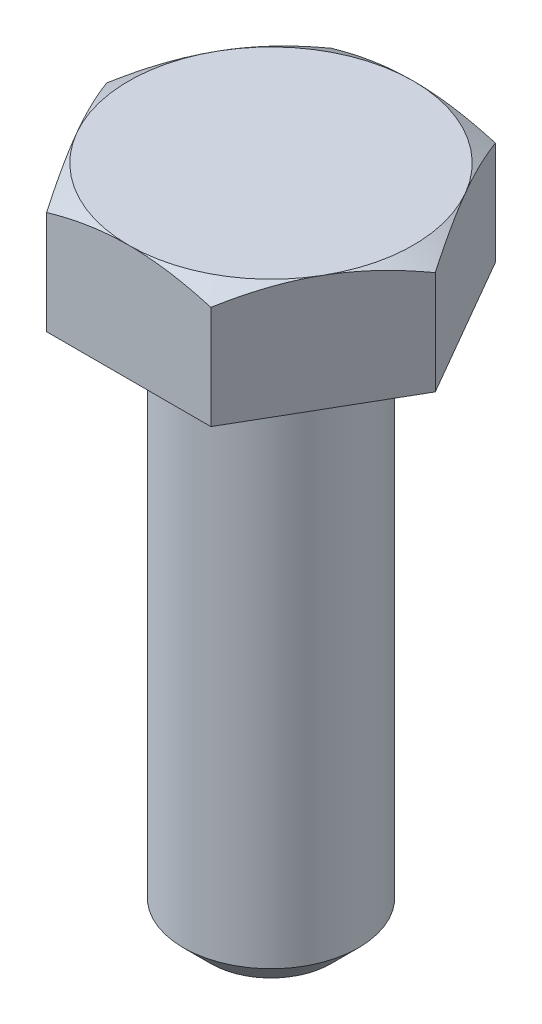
ISO-10303-21;
HEADER;
FILE_DESCRIPTION(('STEP AP214'),'2;1');
FILE_NAME('part.step','',(''),(''),'','','');
FILE_SCHEMA(('AUTOMOTIVE_DESIGN { 1 0 10303 214 1 1 1 1 }'));
ENDSEC;
DATA;
#1=APPLICATION_CONTEXT('core data for automotive mechanical design processes');
#2=APPLICATION_PROTOCOL_DEFINITION('international standard','automotive_design',2000,#1);
#3=PRODUCT_CONTEXT('',#1,'mechanical');
#4=PRODUCT('Part','Part','',(#3));
#5=PRODUCT_RELATED_PRODUCT_CATEGORY('part','',(#4));
#6=PRODUCT_DEFINITION_FORMATION('','',#4);
#7=PRODUCT_DEFINITION_CONTEXT('part definition',#1,'design');
#8=PRODUCT_DEFINITION('design','',#6,#7);
#9=PRODUCT_DEFINITION_SHAPE('','',#8);
#10=(LENGTH_UNIT() NAMED_UNIT(*) SI_UNIT(.MILLI.,.METRE.));
#11=(NAMED_UNIT(*) PLANE_ANGLE_UNIT() SI_UNIT($,.RADIAN.));
#12=(NAMED_UNIT(*) SI_UNIT($,.STERADIAN.) SOLID_ANGLE_UNIT());
#13=UNCERTAINTY_MEASURE_WITH_UNIT(LENGTH_MEASURE(1.E-05),#10,'distance_accuracy_value','');
#14=(GEOMETRIC_REPRESENTATION_CONTEXT(3) GLOBAL_UNCERTAINTY_ASSIGNED_CONTEXT((#13)) GLOBAL_UNIT_ASSIGNED_CONTEXT((#10,
#11,#12)) REPRESENTATION_CONTEXT('',''));
#15=CARTESIAN_POINT('',(0.,0.,0.));
#16=DIRECTION('',(0.,0.,1.));
#17=DIRECTION('',(1.,0.,0.));
#18=AXIS2_PLACEMENT_3D('',#15,#16,#17);
#19=CARTESIAN_POINT('',(0.,0.,0.));
#20=DIRECTION('',(0.,1.,0.));
#21=DIRECTION('',(0.,0.,1.));
#22=AXIS2_PLACEMENT_3D('',#19,#20,#21);
#23=PLANE('',#22);
#24=CARTESIAN_POINT('',(0.,0.,0.));
#25=DIRECTION('',(0.,1.,0.));
#26=DIRECTION('',(0.,0.,1.));
#27=AXIS2_PLACEMENT_3D('',#24,#25,#26);
#28=CIRCLE('',#27,4.);
#29=CARTESIAN_POINT('',(0.,0.,4.00000000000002));
#30=VERTEX_POINT('',#29);
#31=EDGE_CURVE('E189',#30,#30,#28,.T.);
#32=ORIENTED_EDGE('',*,*,#31,.T.);
#33=EDGE_LOOP('',(#32));
#34=FACE_BOUND('',#33,.T.);
#35=DIRECTION('',(0.499999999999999,0.,0.866025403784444));
#36=VECTOR('',#35,1.);
#37=CARTESIAN_POINT('',(3.75277674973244,0.,-6.4999999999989));
#38=LINE('',#37,#36);
#39=CARTESIAN_POINT('',(3.75277674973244,0.,-6.4999999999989));
#40=VERTEX_POINT('',#39);
#41=CARTESIAN_POINT('',(7.50555349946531,-1.94289029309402E-13,9.99200722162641E-13));
#42=VERTEX_POINT('',#41);
#43=EDGE_CURVE('E126',#40,#42,#38,.T.);
#44=ORIENTED_EDGE('',*,*,#43,.T.);
#45=DIRECTION('',(-0.5,0.,0.866025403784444));
#46=VECTOR('',#45,1.);
#47=CARTESIAN_POINT('',(3.7527767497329,0.,6.50000000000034));
#48=LINE('',#47,#46);
#49=CARTESIAN_POINT('',(3.7527767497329,0.,6.50000000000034));
#50=VERTEX_POINT('',#49);
#51=EDGE_CURVE('E124',#42,#50,#48,.T.);
#52=ORIENTED_EDGE('',*,*,#51,.T.);
#53=DIRECTION('',(-1.,0.,0.));
#54=VECTOR('',#53,1.);
#55=CARTESIAN_POINT('',(-3.75277674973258,0.,6.50000000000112));
#56=LINE('',#55,#54);
#57=CARTESIAN_POINT('',(-3.75277674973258,0.,6.50000000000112));
#58=VERTEX_POINT('',#57);
#59=EDGE_CURVE('E54',#50,#58,#56,.T.);
#60=ORIENTED_EDGE('',*,*,#59,.T.);
#61=DIRECTION('',(-0.499999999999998,0.,-0.866025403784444));
#62=VECTOR('',#61,1.);
#63=CARTESIAN_POINT('',(-3.75277674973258,0.,6.50000000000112));
#64=LINE('',#63,#62);
#65=CARTESIAN_POINT('',(-7.50555349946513,-1.38777878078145E-13,4.9960036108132E-13));
#66=VERTEX_POINT('',#65);
#67=EDGE_CURVE('E113',#58,#66,#64,.T.);
#68=ORIENTED_EDGE('',*,*,#67,.T.);
#69=DIRECTION('',(0.5,0.,-0.866025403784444));
#70=VECTOR('',#69,1.);
#71=CARTESIAN_POINT('',(-3.7527767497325,0.,-6.4999999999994));
#72=LINE('',#71,#70);
#73=CARTESIAN_POINT('',(-3.7527767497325,0.,-6.4999999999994));
#74=VERTEX_POINT('',#73);
#75=EDGE_CURVE('E119',#66,#74,#72,.T.);
#76=ORIENTED_EDGE('',*,*,#75,.T.);
#77=DIRECTION('',(1.,0.,0.));
#78=VECTOR('',#77,1.);
#79=CARTESIAN_POINT('',(-3.7527767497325,0.,-6.4999999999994));
#80=LINE('',#79,#78);
#81=EDGE_CURVE('E131',#74,#40,#80,.T.);
#82=ORIENTED_EDGE('',*,*,#81,.T.);
#83=EDGE_LOOP('',(#44,#52,#60,#68,#76,#82));
#84=FACE_BOUND('',#83,.T.);
#85=ADVANCED_FACE('F31',(#34,#84),#23,.F.);
#86=CARTESIAN_POINT('',(-2.65412691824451E-13,-25.0000000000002,7.7715611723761E-13));
#87=DIRECTION('',(0.,1.,0.));
#88=DIRECTION('',(0.,0.,1.));
#89=AXIS2_PLACEMENT_3D('',#86,#87,#88);
#90=CYLINDRICAL_SURFACE('',#89,4.);
#91=CARTESIAN_POINT('',(0.,-23.7500000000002,1.38777878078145E-12));
#92=DIRECTION('',(0.,1.,0.));
#93=DIRECTION('',(0.,0.,1.));
#94=AXIS2_PLACEMENT_3D('',#91,#92,#93);
#95=CIRCLE('',#94,4.);
#96=CARTESIAN_POINT('',(0.,-23.7500000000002,4.00000000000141));
#97=VERTEX_POINT('',#96);
#98=EDGE_CURVE('E39',#97,#97,#95,.T.);
#99=ORIENTED_EDGE('',*,*,#98,.T.);
#100=EDGE_LOOP('',(#99));
#101=FACE_BOUND('',#100,.T.);
#102=ORIENTED_EDGE('',*,*,#31,.F.);
#103=EDGE_LOOP('',(#102));
#104=FACE_BOUND('',#103,.T.);
#105=ADVANCED_FACE('F33',(#101,#104),#90,.T.);
#106=CARTESIAN_POINT('',(-2.65412691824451E-13,-25.0000000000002,7.7715611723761E-13));
#107=DIRECTION('',(0.,1.,0.));
#108=DIRECTION('',(0.,0.,1.));
#109=AXIS2_PLACEMENT_3D('',#106,#107,#108);
#110=PLANE('',#109);
#111=CARTESIAN_POINT('',(-2.65412691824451E-13,-25.0000000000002,7.7715611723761E-13));
#112=DIRECTION('',(0.,1.,0.));
#113=DIRECTION('',(0.,0.,1.));
#114=AXIS2_PLACEMENT_3D('',#111,#112,#113);
#115=CIRCLE('',#114,2.74999999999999);
#116=CARTESIAN_POINT('',(-2.67320887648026E-13,-25.0000000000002,2.75000000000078));
#117=VERTEX_POINT('',#116);
#118=EDGE_CURVE('E11',#117,#117,#115,.F.);
#119=ORIENTED_EDGE('',*,*,#118,.T.);
#120=EDGE_LOOP('',(#119));
#121=FACE_BOUND('',#120,.T.);
#122=ADVANCED_FACE('F199',(#121),#110,.F.);
#123=CARTESIAN_POINT('',(0.,-23.7500000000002,1.38777878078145E-12));
#124=DIRECTION('',(0.,1.,0.));
#125=DIRECTION('',(0.,0.,1.));
#126=AXIS2_PLACEMENT_3D('',#123,#124,#125);
#127=CONICAL_SURFACE('',#126,4.,0.785398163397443);
#128=ORIENTED_EDGE('',*,*,#118,.F.);
#129=EDGE_LOOP('',(#128));
#130=FACE_BOUND('',#129,.T.);
#131=ORIENTED_EDGE('',*,*,#98,.F.);
#132=EDGE_LOOP('',(#131));
#133=FACE_BOUND('',#132,.T.);
#134=ADVANCED_FACE('F169',(#130,#133),#127,.T.);
#135=CARTESIAN_POINT('',(3.75277674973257,5.3,-6.4999999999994));
#136=DIRECTION('',(0.866025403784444,0.,-0.5));
#137=DIRECTION('',(-0.499999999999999,0.,-0.866025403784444));
#138=AXIS2_PLACEMENT_3D('',#135,#136,#137);
#139=PLANE('',#138);
#140=CARTESIAN_POINT('',(3.7526612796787,4.71937674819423,-6.50019999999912));
#141=CARTESIAN_POINT('',(3.83515161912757,4.76699557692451,-6.35732254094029));
#142=CARTESIAN_POINT('',(3.91794952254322,4.81245329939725,-6.21391236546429));
#143=CARTESIAN_POINT('',(4.08421773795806,4.89845131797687,-5.92592736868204));
#144=CARTESIAN_POINT('',(4.16768832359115,4.9389894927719,-5.78135207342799));
#145=CARTESIAN_POINT('',(4.41943655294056,5.05242899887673,-5.34531134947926));
#146=CARTESIAN_POINT('',(4.58870793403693,5.11695219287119,-5.05212471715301));
#147=CARTESIAN_POINT('',(4.84201947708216,5.19261341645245,-4.61337625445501));
#148=CARTESIAN_POINT('',(4.92530276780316,5.21416714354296,-4.46912536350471));
#149=CARTESIAN_POINT('',(5.09224566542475,5.25030968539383,-4.17997178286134));
#150=CARTESIAN_POINT('',(5.17590523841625,5.26489911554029,-4.03506915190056));
#151=CARTESIAN_POINT('',(5.34336968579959,5.28674124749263,-3.74501222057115));
#152=CARTESIAN_POINT('',(5.42717428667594,5.29400227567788,-3.59985839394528));
#153=CARTESIAN_POINT('',(5.59485627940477,5.30103969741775,-3.30942466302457));
#154=CARTESIAN_POINT('',(5.67873366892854,5.30081632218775,-3.16414476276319));
#155=CARTESIAN_POINT('',(5.90853103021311,5.28991654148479,-2.76612405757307));
#156=CARTESIAN_POINT('',(6.05437578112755,5.27161818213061,-2.51351353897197));
#157=CARTESIAN_POINT('',(6.34509659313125,5.21359365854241,-2.00997032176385));
#158=CARTESIAN_POINT('',(6.48997163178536,5.17384766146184,-1.75903939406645));
#159=CARTESIAN_POINT('',(6.78127752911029,5.07449409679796,-1.2544827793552));
#160=CARTESIAN_POINT('',(6.92767163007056,5.01446557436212,-1.00092075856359));
#161=CARTESIAN_POINT('',(7.21827667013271,4.87822500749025,-0.497578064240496));
#162=CARTESIAN_POINT('',(7.36249133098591,4.80204496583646,-0.247790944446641));
#163=CARTESIAN_POINT('',(7.5056689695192,4.719376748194,0.000200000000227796));
#164=B_SPLINE_CURVE_WITH_KNOTS('',3,(#140,#141,#142,#143,#144,#145,#146,#147,#148,#149,#150,
#151,#152,#153,#154,#155,#156,#157,#158,#159,#160,#161,#162,#163),.UNSPECIFIED.,.F.,.F.,(4,2,2,
2,2,2,2,2,2,2,2,4),(0.,0.515105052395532,1.03043143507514,2.0632255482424,2.56697389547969,
3.07067772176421,3.5738086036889,4.07692394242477,4.95279354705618,5.82947446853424,
6.72559912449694,7.61996451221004),.UNSPECIFIED.);
#165=CARTESIAN_POINT('',(3.75277674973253,4.71944341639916,-6.4999999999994));
#166=VERTEX_POINT('',#165);
#167=CARTESIAN_POINT('',(5.6291651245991,5.30000000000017,-3.24999999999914));
#168=VERTEX_POINT('',#167);
#169=EDGE_CURVE('E178',#166,#168,#164,.T.);
#170=ORIENTED_EDGE('',*,*,#169,.T.);
#171=CARTESIAN_POINT('',(7.50555349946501,4.7194434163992,3.33066907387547E-13));
#172=VERTEX_POINT('',#171);
#173=EDGE_CURVE('E172',#168,#172,#164,.T.);
#174=ORIENTED_EDGE('',*,*,#173,.T.);
#175=DIRECTION('',(0.,-1.,0.));
#176=VECTOR('',#175,1.);
#177=CARTESIAN_POINT('',(7.5055534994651,5.30000000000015,1.33226762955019E-12));
#178=LINE('',#177,#176);
#179=EDGE_CURVE('E134',#172,#42,#178,.T.);
#180=ORIENTED_EDGE('',*,*,#179,.T.);
#181=ORIENTED_EDGE('',*,*,#43,.F.);
#182=DIRECTION('',(0.,-1.,0.));
#183=VECTOR('',#182,1.);
#184=CARTESIAN_POINT('',(3.75277674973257,5.3,-6.4999999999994));
#185=LINE('',#184,#183);
#186=EDGE_CURVE('E135',#166,#40,#185,.T.);
#187=ORIENTED_EDGE('',*,*,#186,.F.);
#188=EDGE_LOOP('',(#170,#174,#180,#181,#187));
#189=FACE_BOUND('',#188,.T.);
#190=ADVANCED_FACE('F165',(#189),#139,.T.);
#191=CARTESIAN_POINT('',(-3.75277674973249,5.2999999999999,-6.49999999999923));
#192=DIRECTION('',(0.,0.,-1.));
#193=DIRECTION('',(-1.,0.,0.));
#194=AXIS2_PLACEMENT_3D('',#191,#192,#193);
#195=PLANE('',#194);
#196=CARTESIAN_POINT('',(-10.0886341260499,2.12383891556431,-6.49999999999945));
#197=CARTESIAN_POINT('',(-9.80467346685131,2.26161831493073,-6.49999999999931));
#198=CARTESIAN_POINT('',(-9.52006184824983,2.3980790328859,-6.49999999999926));
#199=CARTESIAN_POINT('',(-8.94919056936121,2.66762164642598,-6.49999999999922));
#200=CARTESIAN_POINT('',(-8.66293065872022,2.80070301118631,-6.49999999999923));
#201=CARTESIAN_POINT('',(-8.08694566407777,3.06341325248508,-6.49999999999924));
#202=CARTESIAN_POINT('',(-7.79721020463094,3.19301945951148,-6.49999999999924));
#203=CARTESIAN_POINT('',(-7.21543776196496,3.44693914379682,-6.49999999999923));
#204=CARTESIAN_POINT('',(-6.92340088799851,3.57125287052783,-6.49999999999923));
#205=CARTESIAN_POINT('',(-6.32709029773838,3.81709528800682,-6.49999999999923));
#206=CARTESIAN_POINT('',(-6.02272572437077,3.93840479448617,-6.49999999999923));
#207=CARTESIAN_POINT('',(-5.41043840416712,4.17186244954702,-6.49999999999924));
#208=CARTESIAN_POINT('',(-5.1025152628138,4.28400957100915,-6.49999999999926));
#209=CARTESIAN_POINT('',(-4.48319586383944,4.49620465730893,-6.4999999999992));
#210=CARTESIAN_POINT('',(-4.17180805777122,4.59627704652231,-6.49999999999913));
#211=CARTESIAN_POINT('',(-3.54456226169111,4.78111569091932,-6.49999999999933));
#212=CARTESIAN_POINT('',(-3.2287057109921,4.86588675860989,-6.49999999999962));
#213=CARTESIAN_POINT('',(-2.59412088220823,5.01561043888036,-6.49999999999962));
#214=CARTESIAN_POINT('',(-2.27541854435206,5.08067123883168,-6.49999999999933));
#215=CARTESIAN_POINT('',(-1.63399658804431,5.18729065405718,-6.49999999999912));
#216=CARTESIAN_POINT('',(-1.31127735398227,5.22885150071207,-6.4999999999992));
#217=CARTESIAN_POINT('',(-0.827615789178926,5.27080862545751,-6.49999999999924));
#218=CARTESIAN_POINT('',(-0.667517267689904,5.2813926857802,-6.49999999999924));
#219=CARTESIAN_POINT('',(-0.347009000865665,5.29578640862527,-6.49999999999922));
#220=CARTESIAN_POINT('',(-0.18659926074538,5.29959618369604,-6.4999999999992));
#221=CARTESIAN_POINT('',(0.134235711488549,5.30034292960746,-6.49999999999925));
#222=CARTESIAN_POINT('',(0.294660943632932,5.29727988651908,-6.49999999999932));
#223=CARTESIAN_POINT('',(0.615239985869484,5.28435797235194,-6.49999999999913));
#224=CARTESIAN_POINT('',(0.775393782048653,5.27449876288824,-6.49999999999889));
#225=CARTESIAN_POINT('',(1.16005135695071,5.24286537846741,-6.49999999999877));
#226=CARTESIAN_POINT('',(1.38429657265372,5.21787974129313,-6.4999999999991));
#227=CARTESIAN_POINT('',(1.83111749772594,5.15594502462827,-6.49999999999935));
#228=CARTESIAN_POINT('',(2.05369297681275,5.11899432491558,-6.49999999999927));
#229=CARTESIAN_POINT('',(2.71866395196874,4.9921542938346,-6.49999999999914));
#230=CARTESIAN_POINT('',(3.15805424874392,4.88630028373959,-6.49999999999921));
#231=CARTESIAN_POINT('',(3.81504923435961,4.70280580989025,-6.49999999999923));
#232=CARTESIAN_POINT('',(4.03606367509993,4.63667213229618,-6.49999999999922));
#233=CARTESIAN_POINT('',(4.47594594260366,4.4975509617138,-6.49999999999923));
#234=CARTESIAN_POINT('',(4.69481375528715,4.42456342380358,-6.49999999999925));
#235=CARTESIAN_POINT('',(5.13047166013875,4.27290430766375,-6.4999999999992));
#236=CARTESIAN_POINT('',(5.34726241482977,4.19423461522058,-6.49999999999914));
#237=CARTESIAN_POINT('',(5.77904901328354,4.03213528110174,-6.4999999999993));
#238=CARTESIAN_POINT('',(5.99404487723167,3.94870569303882,-6.49999999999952));
#239=CARTESIAN_POINT('',(6.49787798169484,3.74779518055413,-6.49999999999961));
#240=CARTESIAN_POINT('',(6.78605784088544,3.62866885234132,-6.49999999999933));
#241=CARTESIAN_POINT('',(7.3599886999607,3.38468569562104,-6.49999999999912));
#242=CARTESIAN_POINT('',(7.64573955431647,3.25982852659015,-6.4999999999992));
#243=CARTESIAN_POINT('',(8.2152536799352,3.00552358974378,-6.49999999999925));
#244=CARTESIAN_POINT('',(8.49901654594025,2.87607491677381,-6.49999999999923));
#245=CARTESIAN_POINT('',(9.06483738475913,2.61349711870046,-6.49999999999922));
#246=CARTESIAN_POINT('',(9.34689532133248,2.48036791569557,-6.49999999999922));
#247=CARTESIAN_POINT('',(9.90987358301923,2.21097485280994,-6.49999999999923));
#248=CARTESIAN_POINT('',(10.190792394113,2.07470783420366,-6.49999999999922));
#249=CARTESIAN_POINT('',(10.7514193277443,1.79970338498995,-6.49999999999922));
#250=CARTESIAN_POINT('',(11.0311274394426,1.66096593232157,-6.49999999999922));
#251=CARTESIAN_POINT('',(11.8686493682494,1.2417363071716,-6.49999999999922));
#252=CARTESIAN_POINT('',(12.4249348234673,0.958191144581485,-6.49999999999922));
#253=CARTESIAN_POINT('',(13.4885090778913,0.409121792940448,-6.49999999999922));
#254=CARTESIAN_POINT('',(13.9960344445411,0.144053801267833,-6.49999999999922));
#255=CARTESIAN_POINT('',(15.009185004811,-0.389728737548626,-6.49999999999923));
#256=CARTESIAN_POINT('',(15.5148101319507,-0.65844341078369,-6.49999999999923));
#257=CARTESIAN_POINT('',(16.5233284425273,-1.19798632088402,-6.49999999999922));
#258=CARTESIAN_POINT('',(17.0262252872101,-1.46880772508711,-6.4999999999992));
#259=CARTESIAN_POINT('',(18.0308017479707,-2.01263443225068,-6.49999999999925));
#260=CARTESIAN_POINT('',(18.5324814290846,-2.28563961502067,-6.49999999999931));
#261=CARTESIAN_POINT('',(19.0337121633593,-2.55946102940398,-6.49999999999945));
#262=B_SPLINE_CURVE_WITH_KNOTS('',3,(#196,#197,#198,#199,#200,#201,#202,#203,#204,#205,#206,
#207,#208,#209,#210,#211,#212,#213,#214,#215,#216,#217,#218,#219,#220,#221,#222,#223,#224,#225,
#226,#227,#228,#229,#230,#231,#232,#233,#234,#235,#236,#237,#238,#239,#240,#241,#242,#243,#244,
#245,#246,#247,#248,#249,#250,#251,#252,#253,#254,#255,#256,#257,#258,#259,#260,#261),
.UNSPECIFIED.,.F.,.F.,(4,2,2,2,2,2,2,2,2,2,2,2,2,2,2,2,2,2,2,2,2,2,2,2,2,2,2,2,2,2,2,2,4),(0.,
0.946875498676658,1.89389882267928,2.84606421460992,3.7981846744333,4.78101743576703,
5.76396022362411,6.74488017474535,7.72549107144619,8.70061769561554,9.67565171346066,
10.1568741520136,10.6380885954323,11.1193040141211,11.600543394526,12.2770600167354,
12.9536682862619,14.3076338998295,14.9996668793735,15.6917043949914,16.3835132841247,
17.0753143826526,18.0107249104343,18.9461910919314,19.8818427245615,20.8175141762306,
21.7541727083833,22.6908396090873,24.5639268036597,26.281638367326,27.9994094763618,
29.7129512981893,31.4263994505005),.UNSPECIFIED.);
#263=CARTESIAN_POINT('',(-3.75277674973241,4.71944341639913,-6.49999999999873));
#264=VERTEX_POINT('',#263);
#265=CARTESIAN_POINT('',(-1.02348685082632E-13,5.3,-6.49999999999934));
#266=VERTEX_POINT('',#265);
#267=EDGE_CURVE('E179',#264,#266,#262,.T.);
#268=ORIENTED_EDGE('',*,*,#267,.T.);
#269=EDGE_CURVE('E180',#266,#166,#262,.T.);
#270=ORIENTED_EDGE('',*,*,#269,.T.);
#271=ORIENTED_EDGE('',*,*,#186,.T.);
#272=ORIENTED_EDGE('',*,*,#81,.F.);
#273=DIRECTION('',(0.,-1.,0.));
#274=VECTOR('',#273,1.);
#275=CARTESIAN_POINT('',(-3.75277674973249,5.2999999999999,-6.49999999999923));
#276=LINE('',#275,#274);
#277=EDGE_CURVE('E138',#264,#74,#276,.T.);
#278=ORIENTED_EDGE('',*,*,#277,.F.);
#279=EDGE_LOOP('',(#268,#270,#271,#272,#278));
#280=FACE_BOUND('',#279,.T.);
#281=ADVANCED_FACE('F168',(#280),#195,.T.);
#282=CARTESIAN_POINT('',(-3.75277674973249,5.2999999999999,-6.49999999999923));
#283=DIRECTION('',(-0.866025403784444,0.,-0.499999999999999));
#284=DIRECTION('',(-0.5,0.,0.866025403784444));
#285=AXIS2_PLACEMENT_3D('',#282,#283,#284);
#286=PLANE('',#285);
#287=CARTESIAN_POINT('',(-7.50566896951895,4.71937674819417,0.000200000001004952));
#288=CARTESIAN_POINT('',(-7.42317863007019,4.76699557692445,-0.142677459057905));
#289=CARTESIAN_POINT('',(-7.34038072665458,4.81245329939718,-0.286087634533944));
#290=CARTESIAN_POINT('',(-7.17411251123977,4.8984513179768,-0.574072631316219));
#291=CARTESIAN_POINT('',(-7.09064192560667,4.93898949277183,-0.718647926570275));
#292=CARTESIAN_POINT('',(-6.83889369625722,5.05242899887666,-1.15468865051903));
#293=CARTESIAN_POINT('',(-6.66962231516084,5.11695219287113,-1.44787528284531));
#294=CARTESIAN_POINT('',(-6.41631077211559,5.19261341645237,-1.88662374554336));
#295=CARTESIAN_POINT('',(-6.33302748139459,5.21416714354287,-2.03087463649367));
#296=CARTESIAN_POINT('',(-6.16608458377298,5.25030968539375,-2.32002821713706));
#297=CARTESIAN_POINT('',(-6.08242501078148,5.26489911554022,-2.46493084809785));
#298=CARTESIAN_POINT('',(-5.91496056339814,5.28674124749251,-2.75498777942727));
#299=CARTESIAN_POINT('',(-5.8311559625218,5.29400227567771,-2.90014160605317));
#300=CARTESIAN_POINT('',(-5.66347396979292,5.3010396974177,-3.19057533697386));
#301=CARTESIAN_POINT('',(-5.5795965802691,5.30081632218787,-3.33585523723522));
#302=CARTESIAN_POINT('',(-5.34979921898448,5.28991654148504,-3.73387594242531));
#303=CARTESIAN_POINT('',(-5.20395446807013,5.27161818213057,-3.98648646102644));
#304=CARTESIAN_POINT('',(-4.9132336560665,5.21359365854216,-4.4900296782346));
#305=CARTESIAN_POINT('',(-4.76835861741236,5.17384766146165,-4.74096060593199));
#306=CARTESIAN_POINT('',(-4.4770527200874,5.0744940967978,-5.24551722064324));
#307=CARTESIAN_POINT('',(-4.33065861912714,5.01446557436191,-5.49907924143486));
#308=CARTESIAN_POINT('',(-4.04005357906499,4.87822500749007,-6.00242193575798));
#309=CARTESIAN_POINT('',(-3.89583891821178,4.80204496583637,-6.25220905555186));
#310=CARTESIAN_POINT('',(-3.75266127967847,4.7193767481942,-6.50019999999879));
#311=B_SPLINE_CURVE_WITH_KNOTS('',3,(#287,#288,#289,#290,#291,#292,#293,#294,#295,#296,#297,
#298,#299,#300,#301,#302,#303,#304,#305,#306,#307,#308,#309,#310),.UNSPECIFIED.,.F.,.F.,(4,2,2,
2,2,2,2,2,2,2,2,4),(0.,0.515105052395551,1.03043143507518,2.06322554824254,2.56697389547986,
3.07067772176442,3.57380860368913,4.07692394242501,4.95279354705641,5.82947446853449,
6.72559912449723,7.61996451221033),.UNSPECIFIED.);
#312=CARTESIAN_POINT('',(-7.5055534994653,4.71944341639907,3.88578058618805E-13));
#313=VERTEX_POINT('',#312);
#314=CARTESIAN_POINT('',(-5.62916512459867,5.30000000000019,-3.24999999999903));
#315=VERTEX_POINT('',#314);
#316=EDGE_CURVE('E316',#313,#315,#311,.T.);
#317=ORIENTED_EDGE('',*,*,#316,.T.);
#318=EDGE_CURVE('E312',#315,#264,#311,.T.);
#319=ORIENTED_EDGE('',*,*,#318,.T.);
#320=ORIENTED_EDGE('',*,*,#277,.T.);
#321=ORIENTED_EDGE('',*,*,#75,.F.);
#322=DIRECTION('',(0.,-1.,0.));
#323=VECTOR('',#322,1.);
#324=CARTESIAN_POINT('',(-7.50555349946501,5.29999999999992,8.32667268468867E-13));
#325=LINE('',#324,#323);
#326=EDGE_CURVE('E109',#313,#66,#325,.T.);
#327=ORIENTED_EDGE('',*,*,#326,.F.);
#328=EDGE_LOOP('',(#317,#319,#320,#321,#327));
#329=FACE_BOUND('',#328,.T.);
#330=ADVANCED_FACE('F281',(#329),#286,.T.);
#331=CARTESIAN_POINT('',(-3.75277674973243,5.29999999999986,6.50000000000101));
#332=DIRECTION('',(-0.866025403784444,0.,0.5));
#333=DIRECTION('',(0.499999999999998,0.,0.866025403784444));
#334=AXIS2_PLACEMENT_3D('',#331,#332,#333);
#335=PLANE('',#334);
#336=CARTESIAN_POINT('',(-3.75266127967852,4.71937674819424,6.50020000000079));
#337=CARTESIAN_POINT('',(-3.83515161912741,4.76699557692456,6.35732254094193));
#338=CARTESIAN_POINT('',(-3.91794952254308,4.81245329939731,6.21391236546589));
#339=CARTESIAN_POINT('',(-4.08421773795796,4.89845131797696,5.92592736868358));
#340=CARTESIAN_POINT('',(-4.16768832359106,4.93898949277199,5.78135207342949));
#341=CARTESIAN_POINT('',(-4.41943655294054,5.05242899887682,5.34531134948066));
#342=CARTESIAN_POINT('',(-4.58870793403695,5.11695219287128,5.05212471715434));
#343=CARTESIAN_POINT('',(-4.84201947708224,5.19261341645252,4.61337625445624));
#344=CARTESIAN_POINT('',(-4.92530276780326,5.21416714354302,4.4691253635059));
#345=CARTESIAN_POINT('',(-5.09224566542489,5.25030968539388,4.17997178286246));
#346=CARTESIAN_POINT('',(-5.1759052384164,5.26489911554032,4.03506915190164));
#347=CARTESIAN_POINT('',(-5.34336968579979,5.28674124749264,3.74501222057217));
#348=CARTESIAN_POINT('',(-5.42717428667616,5.29400227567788,3.59985839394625));
#349=CARTESIAN_POINT('',(-5.59485627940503,5.3010396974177,3.30942466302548));
#350=CARTESIAN_POINT('',(-5.67873366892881,5.30081632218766,3.16414476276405));
#351=CARTESIAN_POINT('',(-5.90853103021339,5.28991654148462,2.76612405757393));
#352=CARTESIAN_POINT('',(-6.05437578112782,5.27161818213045,2.51351353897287));
#353=CARTESIAN_POINT('',(-6.34509659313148,5.21359365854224,2.00997032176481));
#354=CARTESIAN_POINT('',(-6.48997163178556,5.17384766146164,1.75903939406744));
#355=CARTESIAN_POINT('',(-6.78127752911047,5.0744940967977,1.25448277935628));
#356=CARTESIAN_POINT('',(-6.92767163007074,5.01446557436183,1.00092075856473));
#357=CARTESIAN_POINT('',(-7.21827667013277,4.87822500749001,0.497578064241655));
#358=CARTESIAN_POINT('',(-7.36249133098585,4.8020449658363,0.247790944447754));
#359=CARTESIAN_POINT('',(-7.50566896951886,4.71937674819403,-0.000199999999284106));
#360=B_SPLINE_CURVE_WITH_KNOTS('',3,(#336,#337,#338,#339,#340,#341,#342,#343,#344,#345,#346,
#347,#348,#349,#350,#351,#352,#353,#354,#355,#356,#357,#358,#359),.UNSPECIFIED.,.F.,.F.,(4,2,2,
2,2,2,2,2,2,2,2,4),(0.,0.515105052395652,1.03043143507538,2.06322554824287,2.56697389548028,
3.07067772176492,3.57380860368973,4.07692394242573,4.95279354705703,5.82947446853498,
6.72559912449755,7.61996451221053),.UNSPECIFIED.);
#361=CARTESIAN_POINT('',(-3.75277674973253,4.71944341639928,6.50000000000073));
#362=VERTEX_POINT('',#361);
#363=CARTESIAN_POINT('',(-5.62916512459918,5.29999999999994,3.2500000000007));
#364=VERTEX_POINT('',#363);
#365=EDGE_CURVE('E310',#362,#364,#360,.T.);
#366=ORIENTED_EDGE('',*,*,#365,.T.);
#367=EDGE_CURVE('E306',#364,#313,#360,.T.);
#368=ORIENTED_EDGE('',*,*,#367,.T.);
#369=ORIENTED_EDGE('',*,*,#326,.T.);
#370=ORIENTED_EDGE('',*,*,#67,.F.);
#371=DIRECTION('',(0.,-1.,0.));
#372=VECTOR('',#371,1.);
#373=CARTESIAN_POINT('',(-3.75277674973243,5.29999999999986,6.50000000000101));
#374=LINE('',#373,#372);
#375=EDGE_CURVE('E102',#362,#58,#374,.T.);
#376=ORIENTED_EDGE('',*,*,#375,.F.);
#377=EDGE_LOOP('',(#366,#368,#369,#370,#376));
#378=FACE_BOUND('',#377,.T.);
#379=ADVANCED_FACE('F114',(#378),#335,.T.);
#380=CARTESIAN_POINT('',(-3.75277674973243,5.29999999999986,6.50000000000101));
#381=DIRECTION('',(0.,0.,1.));
#382=DIRECTION('',(1.,0.,0.));
#383=AXIS2_PLACEMENT_3D('',#380,#381,#382);
#384=PLANE('',#383);
#385=CARTESIAN_POINT('',(-10.088634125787,2.1238389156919,6.50000000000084));
#386=CARTESIAN_POINT('',(-9.8046734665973,2.26161831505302,6.50000000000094));
#387=CARTESIAN_POINT('',(-9.52006184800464,2.39807903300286,6.50000000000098));
#388=CARTESIAN_POINT('',(-8.9491905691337,2.66762164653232,6.50000000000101));
#389=CARTESIAN_POINT('',(-8.66293065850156,2.80070301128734,6.500000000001));
#390=CARTESIAN_POINT('',(-8.08694566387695,3.06341325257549,6.50000000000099));
#391=CARTESIAN_POINT('',(-7.79721020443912,3.19301945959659,6.500000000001));
#392=CARTESIAN_POINT('',(-7.2154377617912,3.4469391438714,6.500000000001));
#393=CARTESIAN_POINT('',(-6.92340088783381,3.57125287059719,6.500000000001));
#394=CARTESIAN_POINT('',(-6.32709029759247,3.81709528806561,6.500000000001));
#395=CARTESIAN_POINT('',(-6.02272572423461,3.93840479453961,6.500000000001));
#396=CARTESIAN_POINT('',(-5.41043840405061,4.17186244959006,6.500000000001));
#397=CARTESIAN_POINT('',(-5.10251526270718,4.28400957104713,6.50000000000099));
#398=CARTESIAN_POINT('',(-4.48319586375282,4.49620465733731,6.50000000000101));
#399=CARTESIAN_POINT('',(-4.17180805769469,4.59627704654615,6.50000000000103));
#400=CARTESIAN_POINT('',(-3.544562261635,4.78111569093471,6.50000000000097));
#401=CARTESIAN_POINT('',(-3.22870571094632,4.86588675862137,6.50000000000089));
#402=CARTESIAN_POINT('',(-2.59412088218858,5.01561043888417,6.50000000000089));
#403=CARTESIAN_POINT('',(-2.2754185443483,5.08067123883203,6.50000000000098));
#404=CARTESIAN_POINT('',(-1.63399658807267,5.18729065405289,6.50000000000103));
#405=CARTESIAN_POINT('',(-1.31127735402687,5.2288515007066,6.50000000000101));
#406=CARTESIAN_POINT('',(-0.827615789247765,5.27080862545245,6.50000000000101));
#407=CARTESIAN_POINT('',(-0.667517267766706,5.28139268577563,6.50000000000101));
#408=CARTESIAN_POINT('',(-0.347009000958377,5.29578640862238,6.50000000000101));
#409=CARTESIAN_POINT('',(-0.186599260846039,5.29959618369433,6.500000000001));
#410=CARTESIAN_POINT('',(0.134235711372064,5.30034292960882,6.50000000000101));
#411=CARTESIAN_POINT('',(0.294660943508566,5.29727988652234,6.50000000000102));
#412=CARTESIAN_POINT('',(0.615239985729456,5.28435797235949,6.50000000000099));
#413=CARTESIAN_POINT('',(0.775393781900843,5.27449876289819,6.50000000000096));
#414=CARTESIAN_POINT('',(1.16005135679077,5.24286537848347,6.50000000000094));
#415=CARTESIAN_POINT('',(1.38429657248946,5.21787974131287,6.50000000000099));
#416=CARTESIAN_POINT('',(1.83111749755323,5.1559450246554,6.50000000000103));
#417=CARTESIAN_POINT('',(2.05369297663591,5.11899432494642,6.50000000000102));
#418=CARTESIAN_POINT('',(2.7186639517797,4.99215429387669,6.500000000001));
#419=CARTESIAN_POINT('',(3.15805424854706,4.88630028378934,6.500000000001));
#420=CARTESIAN_POINT('',(3.81504923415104,4.70280580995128,6.50000000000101));
#421=CARTESIAN_POINT('',(4.03606367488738,4.636672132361,6.50000000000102));
#422=CARTESIAN_POINT('',(4.4759459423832,4.49755096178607,6.500000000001));
#423=CARTESIAN_POINT('',(4.69481375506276,4.42456342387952,6.50000000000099));
#424=CARTESIAN_POINT('',(5.13047165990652,4.2729043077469,6.50000000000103));
#425=CARTESIAN_POINT('',(5.34726241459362,4.19423461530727,6.50000000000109));
#426=CARTESIAN_POINT('',(5.77904901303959,4.03213528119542,6.50000000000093));
#427=CARTESIAN_POINT('',(5.99404487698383,3.94870569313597,6.50000000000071));
#428=CARTESIAN_POINT('',(6.49787798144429,3.74779518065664,6.50000000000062));
#429=CARTESIAN_POINT('',(6.78605784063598,3.62866885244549,6.50000000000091));
#430=CARTESIAN_POINT('',(7.35998869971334,3.38468569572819,6.50000000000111));
#431=CARTESIAN_POINT('',(7.6457395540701,3.25982852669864,6.50000000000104));
#432=CARTESIAN_POINT('',(8.21525367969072,3.00552358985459,6.50000000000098));
#433=CARTESIAN_POINT('',(8.49901654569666,2.87607491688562,6.500000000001));
#434=CARTESIAN_POINT('',(9.06483738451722,2.61349711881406,6.50000000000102));
#435=CARTESIAN_POINT('',(9.34689532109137,2.48036791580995,6.50000000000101));
#436=CARTESIAN_POINT('',(9.90987358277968,2.21097485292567,6.50000000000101));
#437=CARTESIAN_POINT('',(10.1907923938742,2.07470783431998,6.50000000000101));
#438=CARTESIAN_POINT('',(10.7514193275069,1.79970338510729,6.50000000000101));
#439=CARTESIAN_POINT('',(11.0311274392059,1.66096593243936,6.50000000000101));
#440=CARTESIAN_POINT('',(11.8686493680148,1.24173630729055,6.50000000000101));
#441=CARTESIAN_POINT('',(12.4249348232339,0.958191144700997,6.50000000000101));
#442=CARTESIAN_POINT('',(13.4885090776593,0.409121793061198,6.50000000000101));
#443=CARTESIAN_POINT('',(13.9960344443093,0.144053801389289,6.50000000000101));
#444=CARTESIAN_POINT('',(15.0091850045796,-0.389728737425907,6.50000000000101));
#445=CARTESIAN_POINT('',(15.5148101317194,-0.658443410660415,6.500000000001));
#446=CARTESIAN_POINT('',(16.523328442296,-1.19798632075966,6.50000000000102));
#447=CARTESIAN_POINT('',(17.0262252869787,-1.46880772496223,6.50000000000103));
#448=CARTESIAN_POINT('',(18.0308017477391,-2.01263443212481,6.50000000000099));
#449=CARTESIAN_POINT('',(18.5324814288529,-2.28563961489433,6.50000000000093));
#450=CARTESIAN_POINT('',(19.0337121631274,-2.55946102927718,6.50000000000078));
#451=B_SPLINE_CURVE_WITH_KNOTS('',3,(#385,#386,#387,#388,#389,#390,#391,#392,#393,#394,#395,
#396,#397,#398,#399,#400,#401,#402,#403,#404,#405,#406,#407,#408,#409,#410,#411,#412,#413,#414,
#415,#416,#417,#418,#419,#420,#421,#422,#423,#424,#425,#426,#427,#428,#429,#430,#431,#432,#433,
#434,#435,#436,#437,#438,#439,#440,#441,#442,#443,#444,#445,#446,#447,#448,#449,#450),
.UNSPECIFIED.,.F.,.F.,(4,2,2,2,2,2,2,2,2,2,2,2,2,2,2,2,2,2,2,2,2,2,2,2,2,2,2,2,2,2,2,2,4),(0.,
0.946875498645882,1.89389882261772,2.84606421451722,3.79818467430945,4.78101743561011,
5.76396022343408,6.74488017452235,7.72549107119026,8.70061769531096,9.67565171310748,
10.1568741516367,10.6380885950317,11.1193040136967,11.6005433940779,12.2770600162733,
12.9536682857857,14.307633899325,14.9996668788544,15.6917043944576,16.3835132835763,
17.0753143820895,18.0107249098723,18.9461910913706,19.8818427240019,20.8175141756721,
21.754172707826,22.6908396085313,24.5639268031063,26.2816383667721,27.9994094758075,
29.712951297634,31.4263994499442),.UNSPECIFIED.);
#452=CARTESIAN_POINT('',(3.75277674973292,4.71944341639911,6.50000000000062));
#453=VERTEX_POINT('',#452);
#454=CARTESIAN_POINT('',(3.3133218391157E-13,5.29999999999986,6.50000000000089));
#455=VERTEX_POINT('',#454);
#456=EDGE_CURVE('E311',#453,#455,#451,.F.);
#457=ORIENTED_EDGE('',*,*,#456,.T.);
#458=EDGE_CURVE('E106',#455,#362,#451,.F.);
#459=ORIENTED_EDGE('',*,*,#458,.T.);
#460=ORIENTED_EDGE('',*,*,#375,.T.);
#461=ORIENTED_EDGE('',*,*,#59,.F.);
#462=DIRECTION('',(0.,-1.,0.));
#463=VECTOR('',#462,1.);
#464=CARTESIAN_POINT('',(3.75277674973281,5.29999999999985,6.50000000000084));
#465=LINE('',#464,#463);
#466=EDGE_CURVE('E110',#453,#50,#465,.T.);
#467=ORIENTED_EDGE('',*,*,#466,.F.);
#468=EDGE_LOOP('',(#457,#459,#460,#461,#467));
#469=FACE_BOUND('',#468,.T.);
#470=ADVANCED_FACE('F104',(#469),#384,.T.);
#471=CARTESIAN_POINT('',(3.75277674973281,5.29999999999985,6.50000000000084));
#472=DIRECTION('',(0.866025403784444,0.,0.499999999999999));
#473=DIRECTION('',(0.5,0.,-0.866025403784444));
#474=AXIS2_PLACEMENT_3D('',#471,#472,#473);
#475=PLANE('',#474);
#476=CARTESIAN_POINT('',(7.50566896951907,4.71937674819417,-0.000199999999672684));
#477=CARTESIAN_POINT('',(7.42317863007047,4.76699557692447,0.142677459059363));
#478=CARTESIAN_POINT('',(7.34038072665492,4.81245329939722,0.286087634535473));
#479=CARTESIAN_POINT('',(7.17411251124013,4.89845131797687,0.57407263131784));
#480=CARTESIAN_POINT('',(7.09064192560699,4.93898949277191,0.718647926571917));
#481=CARTESIAN_POINT('',(6.83889369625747,5.05242899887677,1.15468865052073));
#482=CARTESIAN_POINT('',(6.66962231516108,5.11695219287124,1.44787528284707));
#483=CARTESIAN_POINT('',(6.41631077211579,5.19261341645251,1.88662374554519));
#484=CARTESIAN_POINT('',(6.33302748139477,5.21416714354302,2.03087463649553));
#485=CARTESIAN_POINT('',(6.16608458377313,5.25030968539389,2.32002821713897));
#486=CARTESIAN_POINT('',(6.08242501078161,5.26489911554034,2.46493084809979));
#487=CARTESIAN_POINT('',(5.91496056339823,5.28674124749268,2.75498777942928));
#488=CARTESIAN_POINT('',(5.83115596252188,5.29400227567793,2.90014160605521));
#489=CARTESIAN_POINT('',(5.66347396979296,5.30103969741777,3.19057533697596));
#490=CARTESIAN_POINT('',(5.57959658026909,5.30081632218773,3.33585523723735));
#491=CARTESIAN_POINT('',(5.34979921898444,5.28991654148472,3.73387594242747));
#492=CARTESIAN_POINT('',(5.20395446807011,5.27161818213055,3.98648646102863));
#493=CARTESIAN_POINT('',(4.9132336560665,5.21359365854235,4.49002967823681));
#494=CARTESIAN_POINT('',(4.76835861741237,5.17384766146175,4.74096060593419));
#495=CARTESIAN_POINT('',(4.47705272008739,5.07449409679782,5.2455172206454));
#496=CARTESIAN_POINT('',(4.33065861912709,5.01446557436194,5.49907924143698));
#497=CARTESIAN_POINT('',(4.04005357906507,4.87822500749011,6.00242193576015));
#498=CARTESIAN_POINT('',(3.89583891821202,4.8020449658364,6.25220905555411));
#499=CARTESIAN_POINT('',(3.75266127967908,4.71937674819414,6.50020000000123));
#500=B_SPLINE_CURVE_WITH_KNOTS('',3,(#476,#477,#478,#479,#480,#481,#482,#483,#484,#485,#486,
#487,#488,#489,#490,#491,#492,#493,#494,#495,#496,#497,#498,#499),.UNSPECIFIED.,.F.,.F.,(4,2,2,
2,2,2,2,2,2,2,2,4),(0.,0.515105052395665,1.0304314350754,2.06322554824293,2.56697389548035,
3.070677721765,3.57380860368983,4.07692394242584,4.95279354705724,5.82947446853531,
6.725599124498,7.61996451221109),.UNSPECIFIED.);
#501=CARTESIAN_POINT('',(5.62916512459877,5.2999999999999,3.25000000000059));
#502=VERTEX_POINT('',#501);
#503=EDGE_CURVE('E46',#172,#502,#500,.T.);
#504=ORIENTED_EDGE('',*,*,#503,.T.);
#505=EDGE_CURVE('E137',#502,#453,#500,.T.);
#506=ORIENTED_EDGE('',*,*,#505,.T.);
#507=ORIENTED_EDGE('',*,*,#466,.T.);
#508=ORIENTED_EDGE('',*,*,#51,.F.);
#509=ORIENTED_EDGE('',*,*,#179,.F.);
#510=EDGE_LOOP('',(#504,#506,#507,#508,#509));
#511=FACE_BOUND('',#510,.T.);
#512=ADVANCED_FACE('F158',(#511),#475,.T.);
#513=CARTESIAN_POINT('',(2.0643209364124E-13,3.74554897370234,9.43689570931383E-13));
#514=DIRECTION('',(0.,-1.,0.));
#515=DIRECTION('',(0.,0.,-1.));
#516=AXIS2_PLACEMENT_3D('',#513,#514,#515);
#517=CONICAL_SURFACE('',#516,9.19238815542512,1.0471975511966);
#518=ORIENTED_EDGE('',*,*,#365,.F.);
#519=ORIENTED_EDGE('',*,*,#458,.F.);
#520=CARTESIAN_POINT('',(2.55004350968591E-13,5.29999999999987,5.55111512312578E-13));
#521=DIRECTION('',(0.,1.,0.));
#522=DIRECTION('',(0.,0.,1.));
#523=AXIS2_PLACEMENT_3D('',#520,#521,#522);
#524=CIRCLE('',#523,6.5);
#525=EDGE_CURVE('E191',#364,#455,#524,.T.);
#526=ORIENTED_EDGE('',*,*,#525,.F.);
#527=EDGE_LOOP('',(#518,#519,#526));
#528=FACE_BOUND('',#527,.T.);
#529=ADVANCED_FACE('F162',(#528),#517,.T.);
#530=ORIENTED_EDGE('',*,*,#316,.F.);
#531=ORIENTED_EDGE('',*,*,#367,.F.);
#532=EDGE_CURVE('E324',#315,#364,#524,.T.);
#533=ORIENTED_EDGE('',*,*,#532,.F.);
#534=EDGE_LOOP('',(#530,#531,#533));
#535=FACE_BOUND('',#534,.T.);
#536=ADVANCED_FACE('F154',(#535),#517,.T.);
#537=ORIENTED_EDGE('',*,*,#318,.F.);
#538=EDGE_CURVE('E330',#266,#315,#524,.T.);
#539=ORIENTED_EDGE('',*,*,#538,.F.);
#540=ORIENTED_EDGE('',*,*,#267,.F.);
#541=EDGE_LOOP('',(#537,#539,#540));
#542=FACE_BOUND('',#541,.T.);
#543=ADVANCED_FACE('F259',(#542),#517,.T.);
#544=ORIENTED_EDGE('',*,*,#269,.F.);
#545=EDGE_CURVE('E331',#168,#266,#524,.T.);
#546=ORIENTED_EDGE('',*,*,#545,.F.);
#547=ORIENTED_EDGE('',*,*,#169,.F.);
#548=EDGE_LOOP('',(#544,#546,#547));
#549=FACE_BOUND('',#548,.T.);
#550=ADVANCED_FACE('F245',(#549),#517,.T.);
#551=ORIENTED_EDGE('',*,*,#173,.F.);
#552=EDGE_CURVE('E190',#502,#168,#524,.T.);
#553=ORIENTED_EDGE('',*,*,#552,.F.);
#554=ORIENTED_EDGE('',*,*,#503,.F.);
#555=EDGE_LOOP('',(#551,#553,#554));
#556=FACE_BOUND('',#555,.T.);
#557=ADVANCED_FACE('F229',(#556),#517,.T.);
#558=CARTESIAN_POINT('',(2.55004350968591E-13,5.29999999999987,5.55111512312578E-13));
#559=DIRECTION('',(0.,-1.,0.));
#560=DIRECTION('',(0.,0.,-1.));
#561=AXIS2_PLACEMENT_3D('',#558,#559,#560);
#562=PLANE('',#561);
#563=EDGE_CURVE('E186',#455,#502,#524,.T.);
#564=ORIENTED_EDGE('',*,*,#563,.T.);
#565=ORIENTED_EDGE('',*,*,#552,.T.);
#566=ORIENTED_EDGE('',*,*,#545,.T.);
#567=ORIENTED_EDGE('',*,*,#538,.T.);
#568=ORIENTED_EDGE('',*,*,#532,.T.);
#569=ORIENTED_EDGE('',*,*,#525,.T.);
#570=EDGE_LOOP('',(#564,#565,#566,#567,#568,#569));
#571=FACE_BOUND('',#570,.T.);
#572=ADVANCED_FACE('F224',(#571),#562,.F.);
#573=ORIENTED_EDGE('',*,*,#456,.F.);
#574=ORIENTED_EDGE('',*,*,#505,.F.);
#575=ORIENTED_EDGE('',*,*,#563,.F.);
#576=EDGE_LOOP('',(#573,#574,#575));
#577=FACE_BOUND('',#576,.T.);
#578=ADVANCED_FACE('F228',(#577),#517,.T.);
#579=CLOSED_SHELL('',(#85,#105,#122,#134,#190,#281,#330,#379,#470,#512,#529,#536,#543,#550,#557,
#572,#578));
#580=MANIFOLD_SOLID_BREP('B2',#579);
#581=ADVANCED_BREP_SHAPE_REPRESENTATION('',(#18,#580),#14);
#582=SHAPE_DEFINITION_REPRESENTATION(#9,#581);
ENDSEC;
END-ISO-10303-21;
